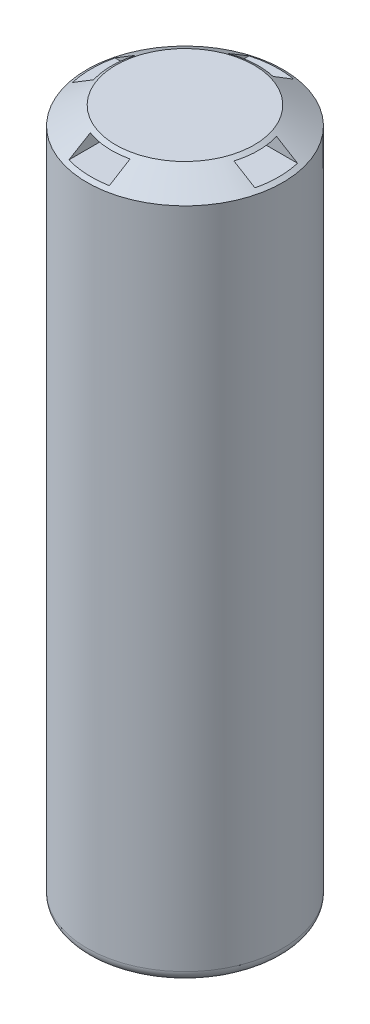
ISO-10303-21;
HEADER;
FILE_DESCRIPTION(('STEP AP214'),'2;1');
FILE_NAME('part.step','',(''),(''),'','','');
FILE_SCHEMA(('AUTOMOTIVE_DESIGN { 1 0 10303 214 1 1 1 1 }'));
ENDSEC;
DATA;
#1=APPLICATION_CONTEXT('core data for automotive mechanical design processes');
#2=APPLICATION_PROTOCOL_DEFINITION('international standard','automotive_design',2000,#1);
#3=PRODUCT_CONTEXT('',#1,'mechanical');
#4=PRODUCT('Part','Part','',(#3));
#5=PRODUCT_RELATED_PRODUCT_CATEGORY('part','',(#4));
#6=PRODUCT_DEFINITION_FORMATION('','',#4);
#7=PRODUCT_DEFINITION_CONTEXT('part definition',#1,'design');
#8=PRODUCT_DEFINITION('design','',#6,#7);
#9=PRODUCT_DEFINITION_SHAPE('','',#8);
#10=(LENGTH_UNIT() NAMED_UNIT(*) SI_UNIT(.MILLI.,.METRE.));
#11=(NAMED_UNIT(*) PLANE_ANGLE_UNIT() SI_UNIT($,.RADIAN.));
#12=(NAMED_UNIT(*) SI_UNIT($,.STERADIAN.) SOLID_ANGLE_UNIT());
#13=UNCERTAINTY_MEASURE_WITH_UNIT(LENGTH_MEASURE(1.E-05),#10,'distance_accuracy_value','');
#14=(GEOMETRIC_REPRESENTATION_CONTEXT(3) GLOBAL_UNCERTAINTY_ASSIGNED_CONTEXT((#13)) GLOBAL_UNIT_ASSIGNED_CONTEXT((#10,
#11,#12)) REPRESENTATION_CONTEXT('',''));
#15=CARTESIAN_POINT('',(0.,0.,0.));
#16=DIRECTION('',(0.,0.,1.));
#17=DIRECTION('',(1.,0.,0.));
#18=AXIS2_PLACEMENT_3D('',#15,#16,#17);
#19=CARTESIAN_POINT('',(0.,63.3,0.));
#20=DIRECTION('',(0.,-1.,0.));
#21=DIRECTION('',(0.,0.,-1.));
#22=AXIS2_PLACEMENT_3D('',#19,#20,#21);
#23=CONICAL_SURFACE('',#22,9.2,1.00887476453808);
#24=CARTESIAN_POINT('',(0.,65.,0.));
#25=DIRECTION('',(0.,-1.,0.));
#26=DIRECTION('',(0.,0.,-1.));
#27=AXIS2_PLACEMENT_3D('',#24,#25,#26);
#28=CIRCLE('',#27,6.5);
#29=CARTESIAN_POINT('',(0.,65.,-6.5));
#30=VERTEX_POINT('',#29);
#31=EDGE_CURVE('E245',#30,#30,#28,.T.);
#32=ORIENTED_EDGE('',*,*,#31,.T.);
#33=EDGE_LOOP('',(#32));
#34=FACE_BOUND('',#33,.T.);
#35=CARTESIAN_POINT('',(0.,63.3,0.));
#36=DIRECTION('',(0.,-1.,0.));
#37=DIRECTION('',(0.,0.,-1.));
#38=AXIS2_PLACEMENT_3D('',#35,#36,#37);
#39=CIRCLE('',#38,9.2);
#40=CARTESIAN_POINT('',(0.,63.3,-9.2));
#41=VERTEX_POINT('',#40);
#42=EDGE_CURVE('E249',#41,#41,#39,.T.);
#43=ORIENTED_EDGE('',*,*,#42,.F.);
#44=EDGE_LOOP('',(#43));
#45=FACE_BOUND('',#44,.T.);
#46=CARTESIAN_POINT('',(0.,64.75,0.));
#47=DIRECTION('',(0.,-1.,0.));
#48=DIRECTION('',(0.,0.,-1.));
#49=AXIS2_PLACEMENT_3D('',#46,#47,#48);
#50=CIRCLE('',#49,6.89705882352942);
#51=CARTESIAN_POINT('',(6.60071362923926,64.75,2.));
#52=VERTEX_POINT('',#51);
#53=CARTESIAN_POINT('',(6.60071362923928,64.75,-2.));
#54=VERTEX_POINT('',#53);
#55=EDGE_CURVE('E273',#52,#54,#50,.F.);
#56=ORIENTED_EDGE('',*,*,#55,.T.);
#57=CARTESIAN_POINT('',(-8.57387591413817,63.5493,-2.));
#58=CARTESIAN_POINT('',(-8.40452955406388,63.6531358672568,-2.));
#59=CARTESIAN_POINT('',(-8.23511426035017,63.7568594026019,-2.));
#60=CARTESIAN_POINT('',(-7.89611427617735,63.9640303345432,-2.));
#61=CARTESIAN_POINT('',(-7.72652958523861,64.0674777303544,-2.));
#62=CARTESIAN_POINT('',(-7.21739583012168,64.3773761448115,-2.));
#63=CARTESIAN_POINT('',(-6.87754663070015,64.5833345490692,-2.));
#64=CARTESIAN_POINT('',(-6.19731616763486,64.9928991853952,-2.));
#65=CARTESIAN_POINT('',(-5.85693716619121,65.196509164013,-2.));
#66=CARTESIAN_POINT('',(-5.3449907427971,65.4995312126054,-2.));
#67=CARTESIAN_POINT('',(-5.17412715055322,65.6001311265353,-2.));
#68=CARTESIAN_POINT('',(-4.8317860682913,65.8002784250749,-2.));
#69=CARTESIAN_POINT('',(-4.66030858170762,65.8998258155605,-2.));
#70=CARTESIAN_POINT('',(-4.25400982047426,66.1335085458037,-2.));
#71=CARTESIAN_POINT('',(-4.01884408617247,66.2670488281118,-2.));
#72=CARTESIAN_POINT('',(-3.66435062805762,66.4643538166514,-2.));
#73=CARTESIAN_POINT('',(-3.54586804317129,66.5296358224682,-2.));
#74=CARTESIAN_POINT('',(-3.3081900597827,66.6588873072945,-2.));
#75=CARTESIAN_POINT('',(-3.18899467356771,66.7228568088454,-2.));
#76=CARTESIAN_POINT('',(-2.94896124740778,66.8494800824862,-2.));
#77=CARTESIAN_POINT('',(-2.82811760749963,66.9121232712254,-2.));
#78=CARTESIAN_POINT('',(-2.585265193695,67.03510193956,-2.));
#79=CARTESIAN_POINT('',(-2.46325648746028,67.0954375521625,-2.));
#80=CARTESIAN_POINT('',(-2.21779183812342,67.2129357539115,-2.));
#81=CARTESIAN_POINT('',(-2.09433671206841,67.270100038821,-2.));
#82=CARTESIAN_POINT('',(-1.84550251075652,67.3800451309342,-2.));
#83=CARTESIAN_POINT('',(-1.7201238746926,67.4328269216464,-2.));
#84=CARTESIAN_POINT('',(-1.47311936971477,67.5297382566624,-2.));
#85=CARTESIAN_POINT('',(-1.35161211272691,67.5741656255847,-2.));
#86=CARTESIAN_POINT('',(-1.10594000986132,67.6551406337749,-2.));
#87=CARTESIAN_POINT('',(-0.981774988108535,67.6916877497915,-2.));
#88=CARTESIAN_POINT('',(-0.732628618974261,67.753402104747,-2.));
#89=CARTESIAN_POINT('',(-0.607691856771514,67.778741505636,-2.));
#90=CARTESIAN_POINT('',(-0.418835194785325,67.8065961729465,-2.));
#91=CARTESIAN_POINT('',(-0.355651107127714,67.8141882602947,-2.));
#92=CARTESIAN_POINT('',(-0.228955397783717,67.8257223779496,-2.));
#93=CARTESIAN_POINT('',(-0.165443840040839,67.8296650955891,-2.));
#94=CARTESIAN_POINT('',(-0.0373519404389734,67.8337669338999,-2.));
#95=CARTESIAN_POINT('',(0.0272302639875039,67.8338689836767,-2.));
#96=CARTESIAN_POINT('',(0.156276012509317,67.8301487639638,-2.));
#97=CARTESIAN_POINT('',(0.220739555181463,67.8263264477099,-2.));
#98=CARTESIAN_POINT('',(0.413665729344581,67.8091707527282,-2.));
#99=CARTESIAN_POINT('',(0.54164546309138,67.7901480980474,-2.));
#100=CARTESIAN_POINT('',(0.797046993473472,67.7392170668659,-2.));
#101=CARTESIAN_POINT('',(0.924426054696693,67.7071046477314,-2.));
#102=CARTESIAN_POINT('',(1.11334869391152,67.6517935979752,-2.));
#103=CARTESIAN_POINT('',(1.17597792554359,67.6321613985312,-2.));
#104=CARTESIAN_POINT('',(1.30056263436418,67.5908687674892,-2.));
#105=CARTESIAN_POINT('',(1.36251814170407,67.5692084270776,-2.));
#106=CARTESIAN_POINT('',(1.53048202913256,67.5078688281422,-2.));
#107=CARTESIAN_POINT('',(1.63587461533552,67.4665077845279,-2.));
#108=CARTESIAN_POINT('',(1.84511231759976,67.380020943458,-2.));
#109=CARTESIAN_POINT('',(1.94895706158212,67.3348942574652,-2.));
#110=CARTESIAN_POINT('',(2.15544807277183,67.2417857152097,-2.));
#111=CARTESIAN_POINT('',(2.25809335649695,67.1938016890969,-2.));
#112=CARTESIAN_POINT('',(2.4623522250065,67.0956798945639,-2.));
#113=CARTESIAN_POINT('',(2.56396574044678,67.0455419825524,-2.));
#114=CARTESIAN_POINT('',(2.86801474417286,66.892439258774,-2.));
#115=CARTESIAN_POINT('',(3.06920047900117,66.7869978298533,-2.));
#116=CARTESIAN_POINT('',(3.46927326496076,66.5721003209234,-2.));
#117=CARTESIAN_POINT('',(3.66816132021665,66.4626460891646,-2.));
#118=CARTESIAN_POINT('',(4.0643692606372,66.2410705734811,-2.));
#119=CARTESIAN_POINT('',(4.26168957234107,66.1289500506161,-2.));
#120=CARTESIAN_POINT('',(4.65528042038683,65.9028381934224,-2.));
#121=CARTESIAN_POINT('',(4.85155084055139,65.7888466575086,-2.));
#122=CARTESIAN_POINT('',(5.24304339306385,65.5596846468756,-2.));
#123=CARTESIAN_POINT('',(5.43826658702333,65.4445159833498,-2.));
#124=CARTESIAN_POINT('',(5.82812848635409,65.2131933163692,-2.));
#125=CARTESIAN_POINT('',(6.02276718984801,65.0970393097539,-2.));
#126=CARTESIAN_POINT('',(6.41455074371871,64.8622118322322,-2.));
#127=CARTESIAN_POINT('',(6.611688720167,64.7435269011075,-2.));
#128=CARTESIAN_POINT('',(7.00566714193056,64.5055216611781,-2.));
#129=CARTESIAN_POINT('',(7.20250747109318,64.3862011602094,-2.));
#130=CARTESIAN_POINT('',(7.59526468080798,64.1474772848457,-2.));
#131=CARTESIAN_POINT('',(7.79118248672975,64.0280754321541,-2.));
#132=CARTESIAN_POINT('',(8.18272206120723,63.7889310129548,-2.));
#133=CARTESIAN_POINT('',(8.37834390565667,63.6691885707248,-2.));
#134=CARTESIAN_POINT('',(8.57387591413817,63.5493,-2.));
#135=B_SPLINE_CURVE_WITH_KNOTS('',3,(#57,#58,#59,#60,#61,#62,#63,#64,#65,#66,#67,#68,#69,#70,
#71,#72,#73,#74,#75,#76,#77,#78,#79,#80,#81,#82,#83,#84,#85,#86,#87,#88,#89,#90,#91,#92,#93,#94,
#95,#96,#97,#98,#99,#100,#101,#102,#103,#104,#105,#106,#107,#108,#109,#110,#111,#112,#113,#114,
#115,#116,#117,#118,#119,#120,#121,#122,#123,#124,#125,#126,#127,#128,#129,#130,#131,#132,#133,
#134),.UNSPECIFIED.,.F.,.F.,(4,2,2,2,2,2,2,2,2,2,2,2,2,2,2,2,2,2,2,2,2,2,2,2,2,2,2,2,2,2,2,2,2,
2,2,2,2,2,4),(0.,0.595936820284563,1.19187533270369,2.38403238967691,3.57390842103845,
4.16874333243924,4.76357492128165,5.57485358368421,5.98067853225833,6.38649650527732,
6.79482416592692,7.20312825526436,7.61121187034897,8.01920365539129,8.40713405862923,
8.79509021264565,9.17686034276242,9.36768538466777,9.55847447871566,9.75209752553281,
9.9457228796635,10.3330285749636,10.7266176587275,10.9234933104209,11.1203601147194,
11.4599070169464,11.7995342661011,12.1394227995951,12.4793340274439,13.1606707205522,
13.8416974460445,14.5225320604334,15.2034405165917,15.8834243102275,16.5634102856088,
17.2537316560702,17.9442751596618,18.6325808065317,19.3206612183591),.UNSPECIFIED.);
#136=CARTESIAN_POINT('',(8.57273429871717,63.55,-2.));
#137=VERTEX_POINT('',#136);
#138=EDGE_CURVE('E59',#54,#137,#135,.T.);
#139=ORIENTED_EDGE('',*,*,#138,.T.);
#140=CARTESIAN_POINT('',(0.,63.55,0.));
#141=DIRECTION('',(0.,1.,0.));
#142=DIRECTION('',(0.,0.,1.));
#143=AXIS2_PLACEMENT_3D('',#140,#141,#142);
#144=CIRCLE('',#143,8.80294117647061);
#145=CARTESIAN_POINT('',(8.57273429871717,63.55,2.));
#146=VERTEX_POINT('',#145);
#147=EDGE_CURVE('E261',#137,#146,#144,.F.);
#148=ORIENTED_EDGE('',*,*,#147,.T.);
#149=CARTESIAN_POINT('',(8.57387591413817,63.5493,2.));
#150=CARTESIAN_POINT('',(8.40452955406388,63.6531358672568,2.));
#151=CARTESIAN_POINT('',(8.23511426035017,63.7568594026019,2.));
#152=CARTESIAN_POINT('',(7.89611427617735,63.9640303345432,2.));
#153=CARTESIAN_POINT('',(7.7265295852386,64.0674777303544,2.));
#154=CARTESIAN_POINT('',(7.21739583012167,64.3773761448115,2.));
#155=CARTESIAN_POINT('',(6.87754663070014,64.5833345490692,2.));
#156=CARTESIAN_POINT('',(6.19731616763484,64.9928991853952,2.));
#157=CARTESIAN_POINT('',(5.85693716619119,65.196509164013,2.));
#158=CARTESIAN_POINT('',(5.34499074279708,65.4995312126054,2.));
#159=CARTESIAN_POINT('',(5.17412715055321,65.6001311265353,2.));
#160=CARTESIAN_POINT('',(4.83178606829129,65.8002784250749,2.));
#161=CARTESIAN_POINT('',(4.66030858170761,65.8998258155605,2.));
#162=CARTESIAN_POINT('',(4.25400982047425,66.1335085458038,2.));
#163=CARTESIAN_POINT('',(4.01884408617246,66.2670488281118,2.));
#164=CARTESIAN_POINT('',(3.66435062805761,66.4643538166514,2.));
#165=CARTESIAN_POINT('',(3.54586804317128,66.5296358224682,2.));
#166=CARTESIAN_POINT('',(3.30819005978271,66.6588873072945,2.));
#167=CARTESIAN_POINT('',(3.18899467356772,66.7228568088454,2.));
#168=CARTESIAN_POINT('',(2.94896124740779,66.8494800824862,2.));
#169=CARTESIAN_POINT('',(2.82811760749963,66.9121232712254,2.));
#170=CARTESIAN_POINT('',(2.58526519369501,67.03510193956,2.));
#171=CARTESIAN_POINT('',(2.4632564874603,67.0954375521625,2.));
#172=CARTESIAN_POINT('',(2.21779183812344,67.2129357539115,2.));
#173=CARTESIAN_POINT('',(2.09433671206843,67.270100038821,2.));
#174=CARTESIAN_POINT('',(1.84550251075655,67.3800451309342,2.));
#175=CARTESIAN_POINT('',(1.72012387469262,67.4328269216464,2.));
#176=CARTESIAN_POINT('',(1.4731193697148,67.5297382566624,2.));
#177=CARTESIAN_POINT('',(1.35161211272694,67.5741656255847,2.));
#178=CARTESIAN_POINT('',(1.10594000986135,67.6551406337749,2.));
#179=CARTESIAN_POINT('',(0.981774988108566,67.6916877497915,2.));
#180=CARTESIAN_POINT('',(0.732628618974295,67.753402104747,2.));
#181=CARTESIAN_POINT('',(0.607691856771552,67.778741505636,2.));
#182=CARTESIAN_POINT('',(0.418835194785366,67.8065961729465,2.));
#183=CARTESIAN_POINT('',(0.355651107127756,67.8141882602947,2.));
#184=CARTESIAN_POINT('',(0.22895539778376,67.8257223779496,2.));
#185=CARTESIAN_POINT('',(0.165443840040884,67.8296650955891,2.));
#186=CARTESIAN_POINT('',(0.03735194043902,67.8337669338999,2.));
#187=CARTESIAN_POINT('',(-0.027230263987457,67.8338689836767,2.));
#188=CARTESIAN_POINT('',(-0.15627601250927,67.8301487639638,2.));
#189=CARTESIAN_POINT('',(-0.220739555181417,67.8263264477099,2.));
#190=CARTESIAN_POINT('',(-0.413665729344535,67.8091707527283,2.));
#191=CARTESIAN_POINT('',(-0.541645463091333,67.7901480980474,2.));
#192=CARTESIAN_POINT('',(-0.797046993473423,67.7392170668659,2.));
#193=CARTESIAN_POINT('',(-0.924426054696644,67.7071046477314,2.));
#194=CARTESIAN_POINT('',(-1.11334869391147,67.6517935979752,2.));
#195=CARTESIAN_POINT('',(-1.17597792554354,67.6321613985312,2.));
#196=CARTESIAN_POINT('',(-1.30056263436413,67.5908687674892,2.));
#197=CARTESIAN_POINT('',(-1.36251814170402,67.5692084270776,2.));
#198=CARTESIAN_POINT('',(-1.5304820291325,67.5078688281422,2.));
#199=CARTESIAN_POINT('',(-1.63587461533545,67.4665077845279,2.));
#200=CARTESIAN_POINT('',(-1.8451123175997,67.380020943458,2.));
#201=CARTESIAN_POINT('',(-1.94895706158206,67.3348942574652,2.));
#202=CARTESIAN_POINT('',(-2.15544807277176,67.2417857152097,2.));
#203=CARTESIAN_POINT('',(-2.25809335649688,67.1938016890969,2.));
#204=CARTESIAN_POINT('',(-2.46235222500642,67.095679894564,2.));
#205=CARTESIAN_POINT('',(-2.5639657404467,67.0455419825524,2.));
#206=CARTESIAN_POINT('',(-2.86801474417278,66.892439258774,2.));
#207=CARTESIAN_POINT('',(-3.06920047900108,66.7869978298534,2.));
#208=CARTESIAN_POINT('',(-3.46927326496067,66.5721003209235,2.));
#209=CARTESIAN_POINT('',(-3.66816132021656,66.4626460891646,2.));
#210=CARTESIAN_POINT('',(-4.0643692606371,66.2410705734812,2.));
#211=CARTESIAN_POINT('',(-4.26168957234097,66.1289500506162,2.));
#212=CARTESIAN_POINT('',(-4.65528042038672,65.9028381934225,2.));
#213=CARTESIAN_POINT('',(-4.85155084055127,65.7888466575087,2.));
#214=CARTESIAN_POINT('',(-5.24304339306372,65.5596846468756,2.));
#215=CARTESIAN_POINT('',(-5.43826658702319,65.4445159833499,2.));
#216=CARTESIAN_POINT('',(-5.82812848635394,65.2131933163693,2.));
#217=CARTESIAN_POINT('',(-6.02276718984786,65.097039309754,2.));
#218=CARTESIAN_POINT('',(-6.41455074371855,64.8622118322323,2.));
#219=CARTESIAN_POINT('',(-6.61168872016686,64.7435269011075,2.));
#220=CARTESIAN_POINT('',(-7.00566714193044,64.5055216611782,2.));
#221=CARTESIAN_POINT('',(-7.20250747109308,64.3862011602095,2.));
#222=CARTESIAN_POINT('',(-7.59526468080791,64.1474772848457,2.));
#223=CARTESIAN_POINT('',(-7.7911824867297,64.0280754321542,2.));
#224=CARTESIAN_POINT('',(-8.18272206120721,63.7889310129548,2.));
#225=CARTESIAN_POINT('',(-8.37834390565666,63.6691885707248,2.));
#226=CARTESIAN_POINT('',(-8.57387591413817,63.5493,2.));
#227=B_SPLINE_CURVE_WITH_KNOTS('',3,(#149,#150,#151,#152,#153,#154,#155,#156,#157,#158,#159,
#160,#161,#162,#163,#164,#165,#166,#167,#168,#169,#170,#171,#172,#173,#174,#175,#176,#177,#178,
#179,#180,#181,#182,#183,#184,#185,#186,#187,#188,#189,#190,#191,#192,#193,#194,#195,#196,#197,
#198,#199,#200,#201,#202,#203,#204,#205,#206,#207,#208,#209,#210,#211,#212,#213,#214,#215,#216,
#217,#218,#219,#220,#221,#222,#223,#224,#225,#226),.UNSPECIFIED.,.F.,.F.,(4,2,2,2,2,2,2,2,2,2,2,
2,2,2,2,2,2,2,2,2,2,2,2,2,2,2,2,2,2,2,2,2,2,2,2,2,2,2,4),(0.,0.595936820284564,1.1918753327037,
2.38403238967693,3.57390842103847,4.16874333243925,4.76357492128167,5.57485358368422,
5.98067853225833,6.38649650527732,6.79482416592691,7.20312825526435,7.61121187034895,
8.01920365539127,8.4071340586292,8.79509021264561,9.17686034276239,9.36768538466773,
9.55847447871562,9.75209752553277,9.94572287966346,10.3330285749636,10.7266176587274,
10.9234933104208,11.1203601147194,11.4599070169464,11.799534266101,12.139422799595,
12.4793340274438,13.1606707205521,13.8416974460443,14.5225320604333,15.2034405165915,
15.8834243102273,16.5634102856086,17.2537316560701,17.9442751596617,18.6325808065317,
19.3206612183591),.UNSPECIFIED.);
#228=EDGE_CURVE('E265',#146,#52,#227,.T.);
#229=ORIENTED_EDGE('',*,*,#228,.T.);
#230=EDGE_LOOP('',(#56,#139,#148,#229));
#231=FACE_BOUND('',#230,.T.);
#232=CARTESIAN_POINT('',(-8.57273429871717,63.55,2.));
#233=VERTEX_POINT('',#232);
#234=CARTESIAN_POINT('',(-8.57273429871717,63.55,-2.));
#235=VERTEX_POINT('',#234);
#236=EDGE_CURVE('E266',#233,#235,#144,.F.);
#237=ORIENTED_EDGE('',*,*,#236,.T.);
#238=CARTESIAN_POINT('',(-6.60071362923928,64.75,-2.));
#239=VERTEX_POINT('',#238);
#240=EDGE_CURVE('E11',#235,#239,#135,.T.);
#241=ORIENTED_EDGE('',*,*,#240,.T.);
#242=CARTESIAN_POINT('',(-6.60071362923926,64.75,2.));
#243=VERTEX_POINT('',#242);
#244=EDGE_CURVE('E71',#239,#243,#50,.F.);
#245=ORIENTED_EDGE('',*,*,#244,.T.);
#246=EDGE_CURVE('E274',#243,#233,#227,.T.);
#247=ORIENTED_EDGE('',*,*,#246,.T.);
#248=EDGE_LOOP('',(#237,#241,#245,#247));
#249=FACE_BOUND('',#248,.T.);
#250=CARTESIAN_POINT('',(0.,64.75,0.));
#251=DIRECTION('',(0.,-1.,0.));
#252=DIRECTION('',(0.,0.,-1.));
#253=AXIS2_PLACEMENT_3D('',#250,#251,#252);
#254=CIRCLE('',#253,6.89705882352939);
#255=CARTESIAN_POINT('',(-2.44261218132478,64.75,6.45004388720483));
#256=VERTEX_POINT('',#255);
#257=CARTESIAN_POINT('',(1.55738781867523,64.75,6.718925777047));
#258=VERTEX_POINT('',#257);
#259=EDGE_CURVE('E152',#256,#258,#254,.F.);
#260=ORIENTED_EDGE('',*,*,#259,.T.);
#261=CARTESIAN_POINT('',(1.55738781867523,63.5493,-8.66521155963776));
#262=CARTESIAN_POINT('',(1.55738781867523,63.7581717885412,-8.32809601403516));
#263=CARTESIAN_POINT('',(1.55738781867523,63.9668209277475,-7.99084140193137));
#264=CARTESIAN_POINT('',(1.55738781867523,64.3833923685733,-7.31570512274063));
#265=CARTESIAN_POINT('',(1.55738781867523,64.5913143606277,-6.97782326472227));
#266=CARTESIAN_POINT('',(1.55738781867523,65.0065374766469,-6.30044738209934));
#267=CARTESIAN_POINT('',(1.55738781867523,65.2138355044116,-5.96095145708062));
#268=CARTESIAN_POINT('',(1.55738781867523,65.6264633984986,-5.28093040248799));
#269=CARTESIAN_POINT('',(1.55738781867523,65.8317939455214,-4.94040568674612));
#270=CARTESIAN_POINT('',(1.55738781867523,66.198010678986,-4.32633952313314));
#271=CARTESIAN_POINT('',(1.55738781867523,66.3594983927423,-4.0531584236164));
#272=CARTESIAN_POINT('',(1.55738781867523,66.599046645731,-3.64163445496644));
#273=CARTESIAN_POINT('',(1.55738781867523,66.678488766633,-3.50409698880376));
#274=CARTESIAN_POINT('',(1.55738781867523,66.8360921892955,-3.22830012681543));
#275=CARTESIAN_POINT('',(1.55738781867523,66.9142535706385,-3.09004077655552));
#276=CARTESIAN_POINT('',(1.55738781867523,67.0690072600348,-2.81213717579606));
#277=CARTESIAN_POINT('',(1.55738781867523,67.1455945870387,-2.67249013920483));
#278=CARTESIAN_POINT('',(1.55738781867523,67.2961374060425,-2.39179248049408));
#279=CARTESIAN_POINT('',(1.55738781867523,67.3700930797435,-2.25074195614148));
#280=CARTESIAN_POINT('',(1.55738781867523,67.5139167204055,-1.96680177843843));
#281=CARTESIAN_POINT('',(1.55738781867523,67.5837905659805,-1.82391515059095));
#282=CARTESIAN_POINT('',(1.55738781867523,67.683748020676,-1.60737806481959));
#283=CARTESIAN_POINT('',(1.55738781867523,67.7162512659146,-1.53484836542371));
#284=CARTESIAN_POINT('',(1.55738781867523,67.7791517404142,-1.38888494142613));
#285=CARTESIAN_POINT('',(1.55738781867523,67.8095491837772,-1.31545130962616));
#286=CARTESIAN_POINT('',(1.55738781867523,67.8713986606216,-1.15786425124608));
#287=CARTESIAN_POINT('',(1.55738781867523,67.9024722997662,-1.07356045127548));
#288=CARTESIAN_POINT('',(1.55738781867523,67.959908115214,-0.903325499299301));
#289=CARTESIAN_POINT('',(1.55738781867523,67.9862697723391,-0.817394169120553));
#290=CARTESIAN_POINT('',(1.55738781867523,68.0323790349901,-0.644948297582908));
#291=CARTESIAN_POINT('',(1.55738781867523,68.0522092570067,-0.558456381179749));
#292=CARTESIAN_POINT('',(1.55738781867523,68.0840078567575,-0.384025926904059));
#293=CARTESIAN_POINT('',(1.55738781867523,68.0959791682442,-0.296087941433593));
#294=CARTESIAN_POINT('',(1.55738781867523,68.1108066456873,-0.117877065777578));
#295=CARTESIAN_POINT('',(1.55738781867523,68.1135011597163,-0.0275901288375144));
#296=CARTESIAN_POINT('',(1.55738781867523,68.1089470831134,0.152720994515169));
#297=CARTESIAN_POINT('',(1.55738781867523,68.1016984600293,0.242745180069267));
#298=CARTESIAN_POINT('',(1.55738781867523,68.0780828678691,0.422640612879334));
#299=CARTESIAN_POINT('',(1.55738781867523,68.0616078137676,0.512497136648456));
#300=CARTESIAN_POINT('',(1.55738781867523,68.0212312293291,0.690511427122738));
#301=CARTESIAN_POINT('',(1.55738781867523,67.9973265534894,0.778668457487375));
#302=CARTESIAN_POINT('',(1.55738781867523,67.9315784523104,0.993605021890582));
#303=CARTESIAN_POINT('',(1.55738781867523,67.8865513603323,1.11939377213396));
#304=CARTESIAN_POINT('',(1.55738781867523,67.788866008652,1.3680105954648));
#305=CARTESIAN_POINT('',(1.55738781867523,67.7362002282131,1.4908356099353));
#306=CARTESIAN_POINT('',(1.55738781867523,67.6258115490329,1.73456450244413));
#307=CARTESIAN_POINT('',(1.55738781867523,67.5680754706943,1.85546234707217));
#308=CARTESIAN_POINT('',(1.55738781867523,67.449347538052,2.09557044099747));
#309=CARTESIAN_POINT('',(1.55738781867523,67.3883570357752,2.21478136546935));
#310=CARTESIAN_POINT('',(1.55738781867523,67.2635922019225,2.45301684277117));
#311=CARTESIAN_POINT('',(1.55738781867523,67.1997987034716,2.57203131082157));
#312=CARTESIAN_POINT('',(1.55738781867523,67.0705679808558,2.80917491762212));
#313=CARTESIAN_POINT('',(1.55738781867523,67.0051306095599,2.92730397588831));
#314=CARTESIAN_POINT('',(1.55738781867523,66.8072860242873,3.28027033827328));
#315=CARTESIAN_POINT('',(1.55738781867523,66.673116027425,3.51411774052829));
#316=CARTESIAN_POINT('',(1.55738781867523,66.4153115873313,3.95748722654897));
#317=CARTESIAN_POINT('',(1.55738781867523,66.2919270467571,4.16715574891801));
#318=CARTESIAN_POINT('',(1.55738781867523,66.0436945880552,4.58562966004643));
#319=CARTESIAN_POINT('',(1.55738781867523,65.9188466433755,4.79443503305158));
#320=CARTESIAN_POINT('',(1.55738781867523,65.6680613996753,5.21159003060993));
#321=CARTESIAN_POINT('',(1.55738781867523,65.5421233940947,5.41993922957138));
#322=CARTESIAN_POINT('',(1.55738781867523,65.2895246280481,5.83619924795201));
#323=CARTESIAN_POINT('',(1.55738781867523,65.1628638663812,6.04411006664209));
#324=CARTESIAN_POINT('',(1.55738781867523,64.7895498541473,6.65515151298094));
#325=CARTESIAN_POINT('',(1.55738781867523,64.5421674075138,7.05783646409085));
#326=CARTESIAN_POINT('',(1.55738781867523,64.1703056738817,7.66116050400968));
#327=CARTESIAN_POINT('',(1.55738781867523,64.0462689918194,7.86207299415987));
#328=CARTESIAN_POINT('',(1.55738781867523,63.7979533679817,8.26374720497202));
#329=CARTESIAN_POINT('',(1.55738781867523,63.6736744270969,8.46450892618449));
#330=CARTESIAN_POINT('',(1.55738781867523,63.5493,8.66521155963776));
#331=B_SPLINE_CURVE_WITH_KNOTS('',3,(#261,#262,#263,#264,#265,#266,#267,#268,#269,#270,#271,
#272,#273,#274,#275,#276,#277,#278,#279,#280,#281,#282,#283,#284,#285,#286,#287,#288,#289,#290,
#291,#292,#293,#294,#295,#296,#297,#298,#299,#300,#301,#302,#303,#304,#305,#306,#307,#308,#309,
#310,#311,#312,#313,#314,#315,#316,#317,#318,#319,#320,#321,#322,#323,#324,#325,#326,#327,#328,
#329,#330),.UNSPECIFIED.,.F.,.F.,(4,2,2,2,2,2,2,2,2,2,2,2,2,2,2,2,2,2,2,2,2,2,2,2,2,2,2,2,2,2,2,
2,2,2,4),(0.,1.18973612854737,2.37992870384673,3.57326890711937,4.76618014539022,
5.71818758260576,6.1946787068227,6.67114010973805,7.14892963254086,7.62668610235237,
8.10373662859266,8.34215062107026,8.58054033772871,8.84998240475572,9.11945414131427,
9.38537320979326,9.65119295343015,9.92162189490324,10.1920517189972,10.4657178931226,
10.7395000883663,11.1398832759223,11.5406633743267,11.9425179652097,12.3442068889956,
12.7492897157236,13.1544089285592,13.9631818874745,14.6930133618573,15.422858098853,
16.1532178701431,16.8835788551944,18.3013824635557,19.0097314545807,19.7180778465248),.UNSPECIFIED.);
#332=CARTESIAN_POINT('',(1.55738781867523,63.55,8.66408197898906));
#333=VERTEX_POINT('',#332);
#334=EDGE_CURVE('E216',#258,#333,#331,.T.);
#335=ORIENTED_EDGE('',*,*,#334,.T.);
#336=CARTESIAN_POINT('',(0.,63.55,0.));
#337=DIRECTION('',(0.,1.,0.));
#338=DIRECTION('',(0.,0.,1.));
#339=AXIS2_PLACEMENT_3D('',#336,#337,#338);
#340=CIRCLE('',#339,8.80294117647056);
#341=CARTESIAN_POINT('',(-2.44261218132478,63.55,8.45727019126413));
#342=VERTEX_POINT('',#341);
#343=EDGE_CURVE('E178',#333,#342,#340,.F.);
#344=ORIENTED_EDGE('',*,*,#343,.T.);
#345=CARTESIAN_POINT('',(-2.44261218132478,63.5493,8.4584273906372));
#346=CARTESIAN_POINT('',(-2.44261218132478,63.6516911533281,8.2891563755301));
#347=CARTESIAN_POINT('',(-2.44261218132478,63.7539136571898,8.11978319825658));
#348=CARTESIAN_POINT('',(-2.44261218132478,63.9579446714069,7.78078630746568));
#349=CARTESIAN_POINT('',(-2.44261218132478,64.0597531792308,7.61116259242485));
#350=CARTESIAN_POINT('',(-2.44261218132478,64.3645018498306,7.10174736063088));
#351=CARTESIAN_POINT('',(-2.44261218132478,64.5667035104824,6.76151346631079));
#352=CARTESIAN_POINT('',(-2.44261218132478,64.969167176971,6.07763683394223));
#353=CARTESIAN_POINT('',(-2.44261218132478,65.1694147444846,5.73398556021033));
#354=CARTESIAN_POINT('',(-2.44261218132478,65.4661777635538,5.21647663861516));
#355=CARTESIAN_POINT('',(-2.44261218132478,65.5644891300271,5.04364985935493));
#356=CARTESIAN_POINT('',(-2.44261218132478,65.7595308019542,4.69710719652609));
#357=CARTESIAN_POINT('',(-2.44261218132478,65.8562611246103,4.52339132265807));
#358=CARTESIAN_POINT('',(-2.44261218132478,66.072140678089,4.13015712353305));
#359=CARTESIAN_POINT('',(-2.44261218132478,66.1906849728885,3.91030574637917));
#360=CARTESIAN_POINT('',(-2.44261218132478,66.4229409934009,3.46793563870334));
#361=CARTESIAN_POINT('',(-2.44261218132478,66.5366509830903,3.24541598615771));
#362=CARTESIAN_POINT('',(-2.44261218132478,66.7015774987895,2.90852945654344));
#363=CARTESIAN_POINT('',(-2.44261218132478,66.7556758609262,2.79557626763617));
#364=CARTESIAN_POINT('',(-2.44261218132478,66.8613796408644,2.56851266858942));
#365=CARTESIAN_POINT('',(-2.44261218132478,66.9129852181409,2.45440233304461));
#366=CARTESIAN_POINT('',(-2.44261218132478,67.0129711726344,2.22482559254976));
#367=CARTESIAN_POINT('',(-2.44261218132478,67.0613529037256,2.10935978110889));
#368=CARTESIAN_POINT('',(-2.44261218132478,67.1539349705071,1.87677370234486));
#369=CARTESIAN_POINT('',(-2.44261218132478,67.1981360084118,1.7596537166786));
#370=CARTESIAN_POINT('',(-2.44261218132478,67.2852579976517,1.51158932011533));
#371=CARTESIAN_POINT('',(-2.44261218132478,67.3276029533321,1.38043936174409));
#372=CARTESIAN_POINT('',(-2.44261218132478,67.403474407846,1.115572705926));
#373=CARTESIAN_POINT('',(-2.44261218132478,67.4370017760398,0.981856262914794));
#374=CARTESIAN_POINT('',(-2.44261218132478,67.4923491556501,0.713474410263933));
#375=CARTESIAN_POINT('',(-2.44261218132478,67.5142929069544,0.578835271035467));
#376=CARTESIAN_POINT('',(-2.44261218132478,67.5447339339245,0.308042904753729));
#377=CARTESIAN_POINT('',(-2.44261218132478,67.5532364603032,0.171890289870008));
#378=CARTESIAN_POINT('',(-2.44261218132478,67.555748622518,-0.101623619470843));
#379=CARTESIAN_POINT('',(-2.44261218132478,67.5496441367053,-0.238986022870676));
#380=CARTESIAN_POINT('',(-2.44261218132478,67.5234918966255,-0.512368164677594));
#381=CARTESIAN_POINT('',(-2.44261218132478,67.5034394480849,-0.648387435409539));
#382=CARTESIAN_POINT('',(-2.44261218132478,67.4512998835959,-0.919653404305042));
#383=CARTESIAN_POINT('',(-2.44261218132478,67.4190776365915,-1.05487343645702));
#384=CARTESIAN_POINT('',(-2.44261218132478,67.3637403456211,-1.25571556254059));
#385=CARTESIAN_POINT('',(-2.44261218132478,67.3441247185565,-1.32233883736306));
#386=CARTESIAN_POINT('',(-2.44261218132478,67.3028583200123,-1.45495037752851));
#387=CARTESIAN_POINT('',(-2.44261218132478,67.281207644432,-1.52093867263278));
#388=CARTESIAN_POINT('',(-2.44261218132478,67.2169791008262,-1.70821602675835));
#389=CARTESIAN_POINT('',(-2.44261218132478,67.1722724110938,-1.8287744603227));
#390=CARTESIAN_POINT('',(-2.44261218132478,67.0782999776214,-2.06811149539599));
#391=CARTESIAN_POINT('',(-2.44261218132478,67.0290330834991,-2.18688963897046));
#392=CARTESIAN_POINT('',(-2.44261218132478,66.9269875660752,-2.42303889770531));
#393=CARTESIAN_POINT('',(-2.44261218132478,66.8742060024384,-2.54040873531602));
#394=CARTESIAN_POINT('',(-2.44261218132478,66.7659677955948,-2.77391256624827));
#395=CARTESIAN_POINT('',(-2.44261218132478,66.7105109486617,-2.89004646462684));
#396=CARTESIAN_POINT('',(-2.44261218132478,66.5973816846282,-3.12157256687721));
#397=CARTESIAN_POINT('',(-2.44261218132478,66.5397042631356,-3.23696231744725));
#398=CARTESIAN_POINT('',(-2.44261218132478,66.4226960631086,-3.4669018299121));
#399=CARTESIAN_POINT('',(-2.44261218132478,66.3633652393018,-3.58145156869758));
#400=CARTESIAN_POINT('',(-2.44261218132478,66.1834008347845,-3.924087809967));
#401=CARTESIAN_POINT('',(-2.44261218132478,66.0608043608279,-4.15114312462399));
#402=CARTESIAN_POINT('',(-2.44261218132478,65.8742145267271,-4.49048825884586));
#403=CARTESIAN_POINT('',(-2.44261218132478,65.8115126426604,-4.60349540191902));
#404=CARTESIAN_POINT('',(-2.44261218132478,65.6853818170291,-4.8290957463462));
#405=CARTESIAN_POINT('',(-2.44261218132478,65.6219529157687,-4.94168897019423));
#406=CARTESIAN_POINT('',(-2.44261218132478,65.4307433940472,-5.2789856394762));
#407=CARTESIAN_POINT('',(-2.44261218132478,65.3020569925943,-5.50317526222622));
#408=CARTESIAN_POINT('',(-2.44261218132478,65.0431464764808,-5.95022179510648));
#409=CARTESIAN_POINT('',(-2.44261218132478,64.9129249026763,-6.17308018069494));
#410=CARTESIAN_POINT('',(-2.44261218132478,64.6512016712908,-6.61804285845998));
#411=CARTESIAN_POINT('',(-2.44261218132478,64.5197000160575,-6.84014715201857));
#412=CARTESIAN_POINT('',(-2.44261218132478,64.3182037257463,-7.17877087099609));
#413=CARTESIAN_POINT('',(-2.44261218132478,64.2485613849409,-7.29550024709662));
#414=CARTESIAN_POINT('',(-2.44261218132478,64.1090227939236,-7.52884427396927));
#415=CARTESIAN_POINT('',(-2.44261218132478,64.0391264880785,-7.64545889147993));
#416=CARTESIAN_POINT('',(-2.44261218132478,63.8993381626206,-7.87820925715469));
#417=CARTESIAN_POINT('',(-2.44261218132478,63.8294467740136,-7.99434538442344));
#418=CARTESIAN_POINT('',(-2.44261218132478,63.6894969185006,-8.2264796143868));
#419=CARTESIAN_POINT('',(-2.44261218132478,63.6194384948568,-8.34247774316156));
#420=CARTESIAN_POINT('',(-2.44261218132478,63.5493,-8.4584273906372));
#421=B_SPLINE_CURVE_WITH_KNOTS('',3,(#345,#346,#347,#348,#349,#350,#351,#352,#353,#354,#355,
#356,#357,#358,#359,#360,#361,#362,#363,#364,#365,#366,#367,#368,#369,#370,#371,#372,#373,#374,
#375,#376,#377,#378,#379,#380,#381,#382,#383,#384,#385,#386,#387,#388,#389,#390,#391,#392,#393,
#394,#395,#396,#397,#398,#399,#400,#401,#402,#403,#404,#405,#406,#407,#408,#409,#410,#411,#412,
#413,#414,#415,#416,#417,#418,#419,#420),.UNSPECIFIED.,.F.,.F.,(4,2,2,2,2,2,2,2,2,2,2,2,2,2,2,2,
2,2,2,2,2,2,2,2,2,2,2,2,2,2,2,2,2,2,2,2,2,4),(0.,0.593489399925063,1.1869824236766,
2.37432526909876,3.5675100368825,4.16400043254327,4.76048433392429,5.50977494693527,
6.25933239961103,6.63502980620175,7.01070314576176,7.38621771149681,7.76166909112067,
8.17488676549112,8.58806368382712,8.99673271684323,9.40524206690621,9.81695342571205,
10.228803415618,10.6453677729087,10.8536957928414,11.0620140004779,11.4476211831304,
11.8333259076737,12.2193574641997,12.6054184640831,12.9924072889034,13.3794067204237,
14.1534665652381,14.5411760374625,14.9288641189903,15.7043459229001,16.4786868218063,
17.2530263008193,17.660803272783,18.068675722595,18.4753101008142,18.8818486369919),.UNSPECIFIED.);
#422=EDGE_CURVE('E169',#342,#256,#421,.T.);
#423=ORIENTED_EDGE('',*,*,#422,.T.);
#424=EDGE_LOOP('',(#260,#335,#344,#423));
#425=FACE_BOUND('',#424,.T.);
#426=CARTESIAN_POINT('',(-2.44261218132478,63.55,-8.45727019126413));
#427=VERTEX_POINT('',#426);
#428=CARTESIAN_POINT('',(1.55738781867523,63.55,-8.66408197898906));
#429=VERTEX_POINT('',#428);
#430=EDGE_CURVE('E225',#427,#429,#340,.F.);
#431=ORIENTED_EDGE('',*,*,#430,.T.);
#432=CARTESIAN_POINT('',(1.55738781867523,64.75,-6.718925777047));
#433=VERTEX_POINT('',#432);
#434=EDGE_CURVE('E223',#429,#433,#331,.T.);
#435=ORIENTED_EDGE('',*,*,#434,.T.);
#436=CARTESIAN_POINT('',(-2.44261218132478,64.75,-6.45004388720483));
#437=VERTEX_POINT('',#436);
#438=EDGE_CURVE('E165',#433,#437,#254,.F.);
#439=ORIENTED_EDGE('',*,*,#438,.T.);
#440=EDGE_CURVE('E181',#437,#427,#421,.T.);
#441=ORIENTED_EDGE('',*,*,#440,.T.);
#442=EDGE_LOOP('',(#431,#435,#439,#441));
#443=FACE_BOUND('',#442,.T.);
#444=ADVANCED_FACE('F55',(#34,#45,#231,#249,#425,#443),#23,.T.);
#445=CARTESIAN_POINT('',(20.,64.75,-2.));
#446=DIRECTION('',(0.,0.,1.));
#447=DIRECTION('',(0.,-1.,0.));
#448=AXIS2_PLACEMENT_3D('',#445,#446,#447);
#449=PLANE('',#448);
#450=DIRECTION('',(-1.,0.,0.));
#451=VECTOR('',#450,1.);
#452=CARTESIAN_POINT('',(20.,64.75,-2.));
#453=LINE('',#452,#451);
#454=CARTESIAN_POINT('',(1.55738781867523,64.75,-2.00000000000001));
#455=VERTEX_POINT('',#454);
#456=EDGE_CURVE('E242',#54,#455,#453,.T.);
#457=ORIENTED_EDGE('',*,*,#456,.T.);
#458=DIRECTION('',(0.,-1.,0.));
#459=VECTOR('',#458,1.);
#460=CARTESIAN_POINT('',(1.55738781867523,64.75,-2.));
#461=LINE('',#460,#459);
#462=CARTESIAN_POINT('',(1.55738781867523,63.55,-2.00000000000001));
#463=VERTEX_POINT('',#462);
#464=EDGE_CURVE('E188',#455,#463,#461,.T.);
#465=ORIENTED_EDGE('',*,*,#464,.T.);
#466=DIRECTION('',(-1.,0.,0.));
#467=VECTOR('',#466,1.);
#468=CARTESIAN_POINT('',(20.,63.55,-2.));
#469=LINE('',#468,#467);
#470=EDGE_CURVE('E229',#137,#463,#469,.T.);
#471=ORIENTED_EDGE('',*,*,#470,.F.);
#472=ORIENTED_EDGE('',*,*,#138,.F.);
#473=EDGE_LOOP('',(#457,#465,#471,#472));
#474=FACE_BOUND('',#473,.T.);
#475=ADVANCED_FACE('F284',(#474),#449,.T.);
#476=CARTESIAN_POINT('',(-2.44261218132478,63.55,-2.));
#477=VERTEX_POINT('',#476);
#478=EDGE_CURVE('E164',#477,#235,#469,.T.);
#479=ORIENTED_EDGE('',*,*,#478,.F.);
#480=DIRECTION('',(0.,1.,0.));
#481=VECTOR('',#480,1.);
#482=CARTESIAN_POINT('',(-2.44261218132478,64.75,-2.));
#483=LINE('',#482,#481);
#484=CARTESIAN_POINT('',(-2.44261218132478,64.75,-2.00000000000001));
#485=VERTEX_POINT('',#484);
#486=EDGE_CURVE('E192',#477,#485,#483,.T.);
#487=ORIENTED_EDGE('',*,*,#486,.T.);
#488=EDGE_CURVE('E241',#485,#239,#453,.T.);
#489=ORIENTED_EDGE('',*,*,#488,.T.);
#490=ORIENTED_EDGE('',*,*,#240,.F.);
#491=EDGE_LOOP('',(#479,#487,#489,#490));
#492=FACE_BOUND('',#491,.T.);
#493=ADVANCED_FACE('F280',(#492),#449,.T.);
#494=CARTESIAN_POINT('',(20.,64.75,2.));
#495=DIRECTION('',(0.,0.,-1.));
#496=DIRECTION('',(0.,1.,0.));
#497=AXIS2_PLACEMENT_3D('',#494,#495,#496);
#498=PLANE('',#497);
#499=DIRECTION('',(-1.,0.,0.));
#500=VECTOR('',#499,1.);
#501=CARTESIAN_POINT('',(20.,63.55,2.));
#502=LINE('',#501,#500);
#503=CARTESIAN_POINT('',(1.55738781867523,63.55,2.));
#504=VERTEX_POINT('',#503);
#505=EDGE_CURVE('E233',#146,#504,#502,.T.);
#506=ORIENTED_EDGE('',*,*,#505,.T.);
#507=DIRECTION('',(0.,1.,0.));
#508=VECTOR('',#507,1.);
#509=CARTESIAN_POINT('',(1.55738781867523,64.75,2.));
#510=LINE('',#509,#508);
#511=CARTESIAN_POINT('',(1.55738781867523,64.75,2.));
#512=VERTEX_POINT('',#511);
#513=EDGE_CURVE('E180',#504,#512,#510,.T.);
#514=ORIENTED_EDGE('',*,*,#513,.T.);
#515=DIRECTION('',(-1.,0.,0.));
#516=VECTOR('',#515,1.);
#517=CARTESIAN_POINT('',(20.,64.75,2.));
#518=LINE('',#517,#516);
#519=EDGE_CURVE('E238',#52,#512,#518,.T.);
#520=ORIENTED_EDGE('',*,*,#519,.F.);
#521=ORIENTED_EDGE('',*,*,#228,.F.);
#522=EDGE_LOOP('',(#506,#514,#520,#521));
#523=FACE_BOUND('',#522,.T.);
#524=ADVANCED_FACE('F275',(#523),#498,.T.);
#525=CARTESIAN_POINT('',(-2.44261218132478,64.75,2.));
#526=VERTEX_POINT('',#525);
#527=EDGE_CURVE('E237',#526,#243,#518,.T.);
#528=ORIENTED_EDGE('',*,*,#527,.F.);
#529=DIRECTION('',(0.,-1.,0.));
#530=VECTOR('',#529,1.);
#531=CARTESIAN_POINT('',(-2.44261218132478,64.75,2.));
#532=LINE('',#531,#530);
#533=CARTESIAN_POINT('',(-2.44261218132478,63.55,2.));
#534=VERTEX_POINT('',#533);
#535=EDGE_CURVE('E172',#526,#534,#532,.T.);
#536=ORIENTED_EDGE('',*,*,#535,.T.);
#537=EDGE_CURVE('E232',#534,#233,#502,.T.);
#538=ORIENTED_EDGE('',*,*,#537,.T.);
#539=ORIENTED_EDGE('',*,*,#246,.F.);
#540=EDGE_LOOP('',(#528,#536,#538,#539));
#541=FACE_BOUND('',#540,.T.);
#542=ADVANCED_FACE('F279',(#541),#498,.T.);
#543=CARTESIAN_POINT('',(0.,65.,0.));
#544=DIRECTION('',(0.,-1.,0.));
#545=DIRECTION('',(0.,0.,-1.));
#546=AXIS2_PLACEMENT_3D('',#543,#544,#545);
#547=CYLINDRICAL_SURFACE('',#546,9.2);
#548=CARTESIAN_POINT('',(0.,1.,0.));
#549=DIRECTION('',(0.,1.,0.));
#550=DIRECTION('',(0.,0.,1.));
#551=AXIS2_PLACEMENT_3D('',#548,#549,#550);
#552=CIRCLE('',#551,9.2);
#553=CARTESIAN_POINT('',(0.,1.,9.2));
#554=VERTEX_POINT('',#553);
#555=EDGE_CURVE('E253',#554,#554,#552,.T.);
#556=ORIENTED_EDGE('',*,*,#555,.T.);
#557=EDGE_LOOP('',(#556));
#558=FACE_BOUND('',#557,.T.);
#559=ORIENTED_EDGE('',*,*,#42,.T.);
#560=EDGE_LOOP('',(#559));
#561=FACE_BOUND('',#560,.T.);
#562=ADVANCED_FACE('F438',(#558,#561),#547,.T.);
#563=CARTESIAN_POINT('',(0.,0.,0.));
#564=DIRECTION('',(0.,1.,0.));
#565=DIRECTION('',(0.,0.,1.));
#566=AXIS2_PLACEMENT_3D('',#563,#564,#565);
#567=PLANE('',#566);
#568=CARTESIAN_POINT('',(0.,0.,0.));
#569=DIRECTION('',(0.,1.,0.));
#570=DIRECTION('',(0.,0.,1.));
#571=AXIS2_PLACEMENT_3D('',#568,#569,#570);
#572=CIRCLE('',#571,8.2);
#573=CARTESIAN_POINT('',(0.,0.,8.2));
#574=VERTEX_POINT('',#573);
#575=EDGE_CURVE('E257',#574,#574,#572,.F.);
#576=ORIENTED_EDGE('',*,*,#575,.T.);
#577=EDGE_LOOP('',(#576));
#578=FACE_BOUND('',#577,.T.);
#579=ADVANCED_FACE('F428',(#578),#567,.F.);
#580=CARTESIAN_POINT('',(0.,1.,0.));
#581=DIRECTION('',(0.,1.,0.));
#582=DIRECTION('',(0.,0.,1.));
#583=AXIS2_PLACEMENT_3D('',#580,#581,#582);
#584=TOROIDAL_SURFACE('',#583,8.2,1.);
#585=ORIENTED_EDGE('',*,*,#575,.F.);
#586=EDGE_LOOP('',(#585));
#587=FACE_BOUND('',#586,.T.);
#588=ORIENTED_EDGE('',*,*,#555,.F.);
#589=EDGE_LOOP('',(#588));
#590=FACE_BOUND('',#589,.T.);
#591=ADVANCED_FACE('F57',(#587,#590),#584,.T.);
#592=CARTESIAN_POINT('',(0.,65.,0.));
#593=DIRECTION('',(0.,1.,0.));
#594=DIRECTION('',(0.,0.,1.));
#595=AXIS2_PLACEMENT_3D('',#592,#593,#594);
#596=PLANE('',#595);
#597=ORIENTED_EDGE('',*,*,#31,.F.);
#598=EDGE_LOOP('',(#597));
#599=FACE_BOUND('',#598,.T.);
#600=ADVANCED_FACE('F283',(#599),#596,.T.);
#601=CARTESIAN_POINT('',(20.,64.75,2.));
#602=DIRECTION('',(0.,-1.,0.));
#603=DIRECTION('',(0.,0.,-1.));
#604=AXIS2_PLACEMENT_3D('',#601,#602,#603);
#605=PLANE('',#604);
#606=ORIENTED_EDGE('',*,*,#488,.F.);
#607=DIRECTION('',(0.,0.,-1.));
#608=VECTOR('',#607,1.);
#609=CARTESIAN_POINT('',(-2.44261218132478,64.75,20.));
#610=LINE('',#609,#608);
#611=EDGE_CURVE('E175',#485,#437,#610,.T.);
#612=ORIENTED_EDGE('',*,*,#611,.T.);
#613=ORIENTED_EDGE('',*,*,#438,.F.);
#614=DIRECTION('',(0.,0.,-1.));
#615=VECTOR('',#614,1.);
#616=CARTESIAN_POINT('',(1.55738781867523,64.75,20.));
#617=LINE('',#616,#615);
#618=EDGE_CURVE('E174',#455,#433,#617,.T.);
#619=ORIENTED_EDGE('',*,*,#618,.F.);
#620=ORIENTED_EDGE('',*,*,#456,.F.);
#621=ORIENTED_EDGE('',*,*,#55,.F.);
#622=ORIENTED_EDGE('',*,*,#519,.T.);
#623=EDGE_CURVE('E159',#258,#512,#617,.T.);
#624=ORIENTED_EDGE('',*,*,#623,.F.);
#625=ORIENTED_EDGE('',*,*,#259,.F.);
#626=EDGE_CURVE('E156',#256,#526,#610,.T.);
#627=ORIENTED_EDGE('',*,*,#626,.T.);
#628=ORIENTED_EDGE('',*,*,#527,.T.);
#629=ORIENTED_EDGE('',*,*,#244,.F.);
#630=EDGE_LOOP('',(#606,#612,#613,#619,#620,#621,#622,#624,#625,#627,#628,#629));
#631=FACE_BOUND('',#630,.T.);
#632=ADVANCED_FACE('F155',(#631),#605,.T.);
#633=CARTESIAN_POINT('',(20.,63.55,2.));
#634=DIRECTION('',(0.,1.,0.));
#635=DIRECTION('',(0.,0.,1.));
#636=AXIS2_PLACEMENT_3D('',#633,#634,#635);
#637=PLANE('',#636);
#638=ORIENTED_EDGE('',*,*,#537,.F.);
#639=DIRECTION('',(0.,0.,-1.));
#640=VECTOR('',#639,1.);
#641=CARTESIAN_POINT('',(-2.44261218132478,63.55,20.));
#642=LINE('',#641,#640);
#643=EDGE_CURVE('E85',#342,#534,#642,.T.);
#644=ORIENTED_EDGE('',*,*,#643,.F.);
#645=ORIENTED_EDGE('',*,*,#343,.F.);
#646=DIRECTION('',(0.,0.,-1.));
#647=VECTOR('',#646,1.);
#648=CARTESIAN_POINT('',(1.55738781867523,63.55,20.));
#649=LINE('',#648,#647);
#650=EDGE_CURVE('E338',#333,#504,#649,.T.);
#651=ORIENTED_EDGE('',*,*,#650,.T.);
#652=ORIENTED_EDGE('',*,*,#505,.F.);
#653=ORIENTED_EDGE('',*,*,#147,.F.);
#654=ORIENTED_EDGE('',*,*,#470,.T.);
#655=EDGE_CURVE('E78',#463,#429,#649,.T.);
#656=ORIENTED_EDGE('',*,*,#655,.T.);
#657=ORIENTED_EDGE('',*,*,#430,.F.);
#658=EDGE_CURVE('E324',#477,#427,#642,.T.);
#659=ORIENTED_EDGE('',*,*,#658,.F.);
#660=ORIENTED_EDGE('',*,*,#478,.T.);
#661=ORIENTED_EDGE('',*,*,#236,.F.);
#662=EDGE_LOOP('',(#638,#644,#645,#651,#652,#653,#654,#656,#657,#659,#660,#661));
#663=FACE_BOUND('',#662,.T.);
#664=ADVANCED_FACE('F207',(#663),#637,.T.);
#665=CARTESIAN_POINT('',(-2.44261218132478,64.75,20.));
#666=DIRECTION('',(1.,0.,0.));
#667=DIRECTION('',(0.,1.,0.));
#668=AXIS2_PLACEMENT_3D('',#665,#666,#667);
#669=PLANE('',#668);
#670=ORIENTED_EDGE('',*,*,#643,.T.);
#671=ORIENTED_EDGE('',*,*,#535,.F.);
#672=ORIENTED_EDGE('',*,*,#626,.F.);
#673=ORIENTED_EDGE('',*,*,#422,.F.);
#674=EDGE_LOOP('',(#670,#671,#672,#673));
#675=FACE_BOUND('',#674,.T.);
#676=ADVANCED_FACE('F168',(#675),#669,.T.);
#677=CARTESIAN_POINT('',(1.55738781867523,64.75,20.));
#678=DIRECTION('',(-1.,0.,0.));
#679=DIRECTION('',(0.,0.,1.));
#680=AXIS2_PLACEMENT_3D('',#677,#678,#679);
#681=PLANE('',#680);
#682=ORIENTED_EDGE('',*,*,#623,.T.);
#683=ORIENTED_EDGE('',*,*,#513,.F.);
#684=ORIENTED_EDGE('',*,*,#650,.F.);
#685=ORIENTED_EDGE('',*,*,#334,.F.);
#686=EDGE_LOOP('',(#682,#683,#684,#685));
#687=FACE_BOUND('',#686,.T.);
#688=ADVANCED_FACE('F206',(#687),#681,.T.);
#689=ORIENTED_EDGE('',*,*,#655,.F.);
#690=ORIENTED_EDGE('',*,*,#464,.F.);
#691=ORIENTED_EDGE('',*,*,#618,.T.);
#692=ORIENTED_EDGE('',*,*,#434,.F.);
#693=EDGE_LOOP('',(#689,#690,#691,#692));
#694=FACE_BOUND('',#693,.T.);
#695=ADVANCED_FACE('F212',(#694),#681,.T.);
#696=ORIENTED_EDGE('',*,*,#611,.F.);
#697=ORIENTED_EDGE('',*,*,#486,.F.);
#698=ORIENTED_EDGE('',*,*,#658,.T.);
#699=ORIENTED_EDGE('',*,*,#440,.F.);
#700=EDGE_LOOP('',(#696,#697,#698,#699));
#701=FACE_BOUND('',#700,.T.);
#702=ADVANCED_FACE('F208',(#701),#669,.T.);
#703=CLOSED_SHELL('',(#444,#475,#493,#524,#542,#562,#579,#591,#600,#632,#664,#676,#688,#695,#702));
#704=MANIFOLD_SOLID_BREP('B2',#703);
#705=ADVANCED_BREP_SHAPE_REPRESENTATION('',(#18,#704),#14);
#706=SHAPE_DEFINITION_REPRESENTATION(#9,#705);
ENDSEC;
END-ISO-10303-21;
